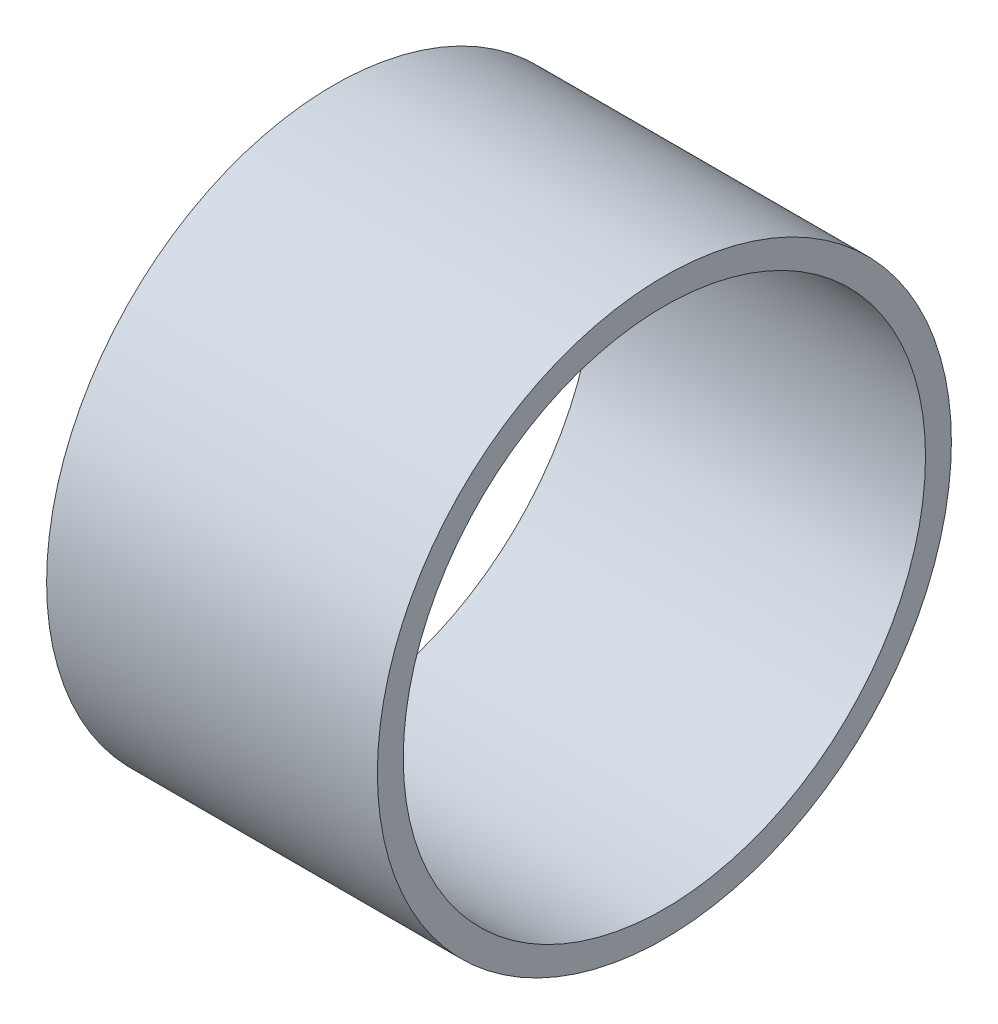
from build123d import *

# Parameters (mm, degrees)
ESQUISSE1_R        = 69.85
ESQUISSE1_R_2      = 63.55
EXTRU_MINCE1_DEPTH = 80.5


with BuildPart() as part:
    # Esquisse1 → Extru.-Mince1 (new body)
    with BuildSketch(Plane(origin=(-898.897366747, 0, 0), x_dir=(0, 0, -1), z_dir=(1, 0, 0))):
        with Locations((-1000, -877.904505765)):
            Circle(ESQUISSE1_R)
        with Locations((-1000, -877.904505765)):
            Circle(ESQUISSE1_R_2, mode=Mode.SUBTRACT)
    extrude(amount=-EXTRU_MINCE1_DEPTH)


solid = part.part
